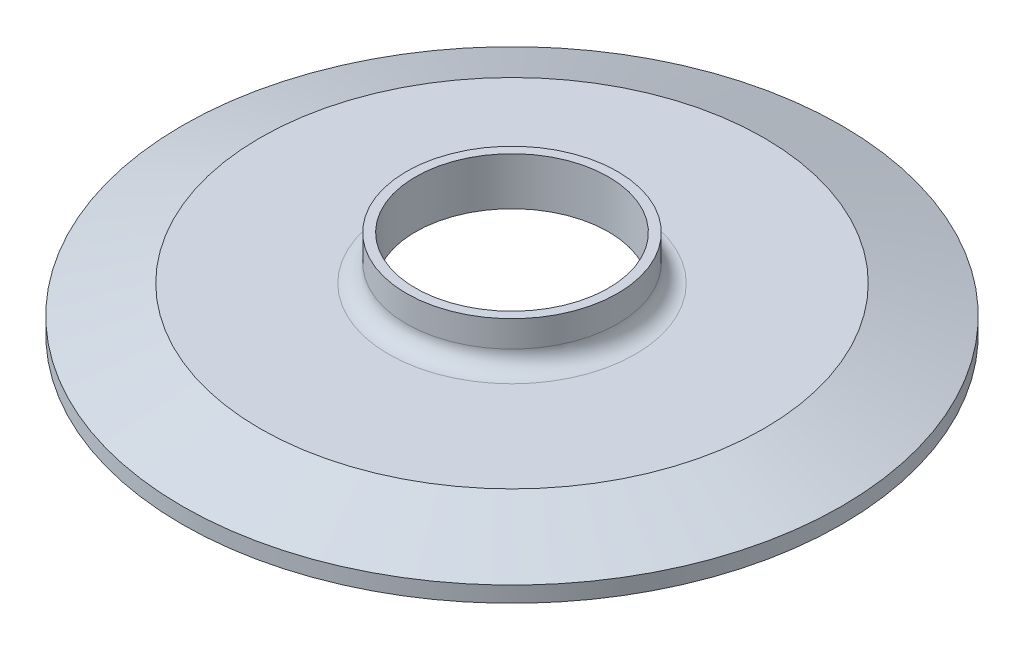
from build123d import *


with BuildPart() as part:
    # Sketch1 → Revolve1 (revolve)
    with BuildSketch(Plane.XY, mode=Mode.PRIVATE) as revolve1_sk:
        with BuildLine():
            Line((-19.05, 15.875), (-19.05, 11.1252))
            ThreePointArc((-19.05, 11.1252), (-19.97993597, 8.88013597), (-22.225, 7.9502))
            Line((-22.225, 7.9502), (-45.434428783, 7.9502))
            Line((-45.434428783, 7.9502), (-59.4614, 2.8448))
            Line((-59.4614, 2.8448), (-59.4614, 0))
            Line((-59.4614, 0), (-56.92485771, 0))
            ThreePointArc((-56.92485771, 0), (-56.416561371, 0.086556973), (-56.070800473, 0.469057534))
            Line((-56.070800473, 0.469057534), (-55.899398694, 0.872854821))
            ThreePointArc((-55.899398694, 0.872854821), (-54.8005, 1.6002), (-53.701601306, 0.872854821))
            Line((-53.701601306, 0.872854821), (-53.534733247, 0.479738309))
            ThreePointArc((-53.534733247, 0.479738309), (-53.244522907, 0.130798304), (-52.809927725, 0))
            Line((-52.809927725, 0), (-48.6918, 0))
            Line((-48.6918, 0), (-17.399, 7.282062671))
            Line((-17.399, 7.282062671), (-17.399, 15.875))
            Line((-17.399, 15.875), (-19.05, 15.875))
        make_face()
    revolve(revolve1_sk.sketch.rotate(Axis((0, 0, 0), (0, 1, 0)), 270), axis=Axis((0, 0, 0), (0, 1, 0)))


solid = part.part
